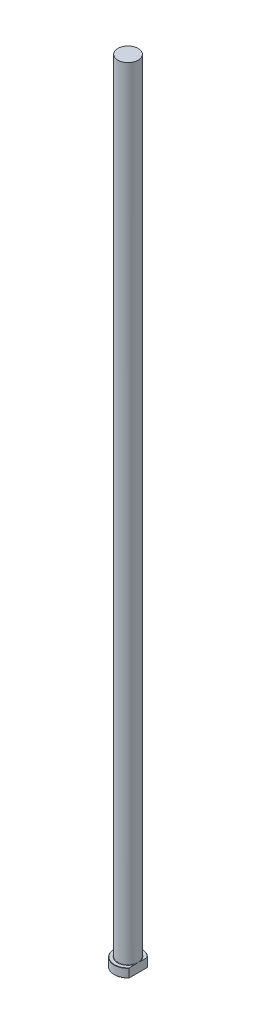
from build123d import *
from build123d.topology import SkipClean

# Parameters (mm, degrees)
CHAMFER1_SIZE = 0.2
FILLET1_R     = 0.3
KEY_DEPTH     = 631.192034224


with BuildPart() as part:
    # Sketch1 → Revolve1 (revolve)
    with BuildSketch(Plane.XY, mode=Mode.PRIVATE) as revolve1_sk:
        Polygon((0, 0), (-11, 0), (-11, 7), (-8.1, 7), (-8.1, 630), (0, 630), align=None)
    revolve(revolve1_sk.sketch.rotate(Axis((0, 259.958771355, 0), (0, -1, 0)), 270), axis=Axis((0, 259.958771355, 0), (0, -1, 0)))

    # Chamfer1
    chamfer1_edges = [part.edges().sort_by_distance(p)[0] for p in [
        (0, 7, -11),
        (0, 0, -11),
    ]]
    chamfer(chamfer1_edges, length=CHAMFER1_SIZE)

    # Fillet1
    fillet1_edges = [part.edges().sort_by_distance(p)[0] for p in [
        (0, 7, -8.1),
    ]]
    fillet(fillet1_edges, radius=FILLET1_R)

    # Sketch2 → KEY (cut, through all)
    with SkipClean():  # the faces are left unmerged after this step: merging them gives an invalid solid
        with BuildSketch(Plane(origin=(0, 0, 0), x_dir=(1, 0, 0), z_dir=(0, 1, 0))):
            with BuildLine():
                Line((8.1, 7.442445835), (8.1, -7.442445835))
                ThreePointArc((8.1, -7.442445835), (11, 0), (8.1, 7.442445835))
            make_face()
        extrude(amount=KEY_DEPTH, mode=Mode.SUBTRACT)


solid = part.part
